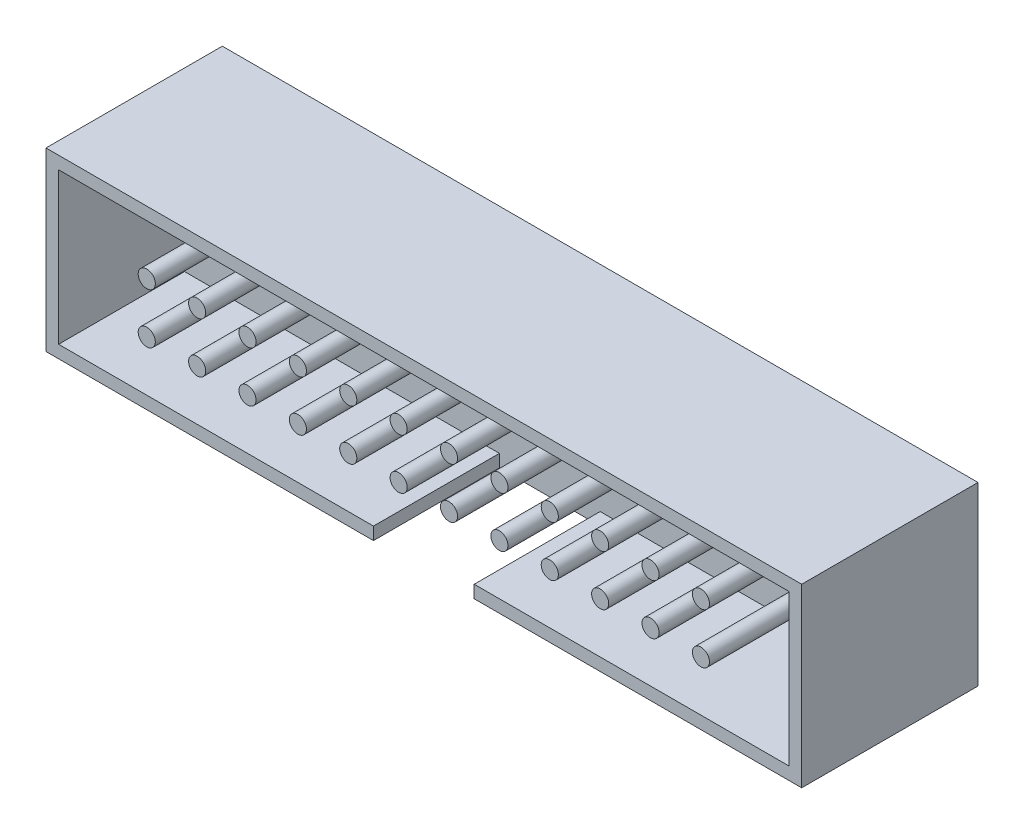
from build123d import *

# Parameters (mm, degrees)
SKETCH1_W                   = 38.1
SKETCH1_H                   = 8.89
BOSS_EXTRUDE1_DEPTH         = 2.54
SKETCH4_W                   = 0.635
SKETCH4_H                   = 8.89
BOSS_EXTRUDE2_DEPTH         = 6.35
SKETCH5_W                   = 36.83
SKETCH5_H                   = 0.635
SKETCH5_W_2                 = 15.875
BOSS_EXTRUDE3_DEPTH         = 6.35
BOSS_EXTRUDE4_DEPTH         = 2.54
BOSS_EXTRUDE4_DEPTH_BACK    = 8.89
SKETCH6_R                   = 0.4318
BOSS_EXTRUDE4_2_DEPTH       = 2.54
BOSS_EXTRUDE4_2_DEPTH_BACK  = 8.89
BOSS_EXTRUDE4_3_DEPTH       = 2.54
BOSS_EXTRUDE4_3_DEPTH_BACK  = 8.89
BOSS_EXTRUDE4_4_DEPTH       = 2.54
BOSS_EXTRUDE4_4_DEPTH_BACK  = 8.89
BOSS_EXTRUDE4_5_DEPTH       = 2.54
BOSS_EXTRUDE4_5_DEPTH_BACK  = 8.89
BOSS_EXTRUDE4_6_DEPTH       = 2.54
BOSS_EXTRUDE4_6_DEPTH_BACK  = 8.89
BOSS_EXTRUDE4_7_DEPTH       = 2.54
BOSS_EXTRUDE4_7_DEPTH_BACK  = 8.89
BOSS_EXTRUDE4_8_DEPTH       = 2.54
BOSS_EXTRUDE4_8_DEPTH_BACK  = 8.89
BOSS_EXTRUDE4_9_DEPTH       = 2.54
BOSS_EXTRUDE4_9_DEPTH_BACK  = 8.89
BOSS_EXTRUDE4_10_DEPTH      = 2.54
BOSS_EXTRUDE4_10_DEPTH_BACK = 8.89
BOSS_EXTRUDE4_11_DEPTH      = 2.54
BOSS_EXTRUDE4_11_DEPTH_BACK = 8.89
BOSS_EXTRUDE4_12_DEPTH      = 2.54
BOSS_EXTRUDE4_12_DEPTH_BACK = 8.89
BOSS_EXTRUDE4_13_DEPTH      = 2.54
BOSS_EXTRUDE4_13_DEPTH_BACK = 8.89
BOSS_EXTRUDE4_14_DEPTH      = 2.54
BOSS_EXTRUDE4_14_DEPTH_BACK = 8.89
BOSS_EXTRUDE4_15_DEPTH      = 2.54
BOSS_EXTRUDE4_15_DEPTH_BACK = 8.89
BOSS_EXTRUDE4_16_DEPTH      = 2.54
BOSS_EXTRUDE4_16_DEPTH_BACK = 8.89
BOSS_EXTRUDE4_17_DEPTH      = 2.54
BOSS_EXTRUDE4_17_DEPTH_BACK = 8.89
BOSS_EXTRUDE4_18_DEPTH      = 2.54
BOSS_EXTRUDE4_18_DEPTH_BACK = 8.89
BOSS_EXTRUDE4_19_DEPTH      = 2.54
BOSS_EXTRUDE4_19_DEPTH_BACK = 8.89
BOSS_EXTRUDE4_20_DEPTH      = 2.54
BOSS_EXTRUDE4_20_DEPTH_BACK = 8.89
BOSS_EXTRUDE4_21_DEPTH      = 2.54
BOSS_EXTRUDE4_21_DEPTH_BACK = 8.89
BOSS_EXTRUDE4_22_DEPTH      = 2.54
BOSS_EXTRUDE4_22_DEPTH_BACK = 8.89
BOSS_EXTRUDE4_23_DEPTH      = 2.54
BOSS_EXTRUDE4_23_DEPTH_BACK = 8.89
BOSS_EXTRUDE4_24_DEPTH      = 2.54
BOSS_EXTRUDE4_24_DEPTH_BACK = 8.89


with BuildPart() as part:
    # Sketch1 → Boss-Extrude1 (new body)
    with BuildSketch(Plane.XY):
        with Locations((13.97, 1.27)):
            Rectangle(SKETCH1_W, SKETCH1_H)
    extrude(amount=BOSS_EXTRUDE1_DEPTH)

    # Sketch4 → Boss-Extrude2 (add)
    with BuildSketch(Plane.XY.offset(2.54)):
        with Locations((-4.7625, 1.27)):
            Rectangle(SKETCH4_W, SKETCH4_H)
        with Locations((32.7025, 1.27)):
            Rectangle(SKETCH4_W, SKETCH4_H)
    extrude(amount=BOSS_EXTRUDE2_DEPTH)

    # Sketch5 → Boss-Extrude3 (add)
    with BuildSketch(Plane.XY.offset(2.54)):
        with Locations((13.97, 5.3975)):
            Rectangle(SKETCH5_W, SKETCH5_H)
        with Locations((3.4925, -2.8575)):
            Rectangle(SKETCH5_W_2, SKETCH5_H)
        with Locations((24.4475, -2.8575)):
            Rectangle(SKETCH5_W_2, SKETCH5_H)
    extrude(amount=BOSS_EXTRUDE3_DEPTH)


with BuildPart() as body_2:
    # Sketch6 → Boss-Extrude4 (new, two sides: drawn at the far end of the back side and taken through both)
    with BuildSketch(Plane(origin=(0, 0, 0), x_dir=(-1, 0, 0), z_dir=(0, 0, -1)).offset(-BOSS_EXTRUDE4_DEPTH_BACK)):
        Circle(SKETCH6_R)
    extrude(amount=BOSS_EXTRUDE4_DEPTH + BOSS_EXTRUDE4_DEPTH_BACK)


with BuildPart() as body_3:
    # Sketch6 → Boss-Extrude4 2 (new, two sides: drawn at the far end of the back side and taken through both)
    with BuildSketch(Plane(origin=(0, 0, 0), x_dir=(-1, 0, 0), z_dir=(0, 0, -1)).offset(-BOSS_EXTRUDE4_2_DEPTH_BACK)):
        with Locations((0, 2.54)):
            Circle(SKETCH6_R)
    extrude(amount=BOSS_EXTRUDE4_2_DEPTH + BOSS_EXTRUDE4_2_DEPTH_BACK)


with BuildPart() as body_4:
    # Sketch6 → Boss-Extrude4 3 (new, two sides: drawn at the far end of the back side and taken through both)
    with BuildSketch(Plane(origin=(0, 0, 0), x_dir=(-1, 0, 0), z_dir=(0, 0, -1)).offset(-BOSS_EXTRUDE4_3_DEPTH_BACK)):
        with Locations((-2.54, 0)):
            Circle(SKETCH6_R)
    extrude(amount=BOSS_EXTRUDE4_3_DEPTH + BOSS_EXTRUDE4_3_DEPTH_BACK)


with BuildPart() as body_5:
    # Sketch6 → Boss-Extrude4 4 (new, two sides: drawn at the far end of the back side and taken through both)
    with BuildSketch(Plane(origin=(0, 0, 0), x_dir=(-1, 0, 0), z_dir=(0, 0, -1)).offset(-BOSS_EXTRUDE4_4_DEPTH_BACK)):
        with Locations((-5.08, 0)):
            Circle(SKETCH6_R)
    extrude(amount=BOSS_EXTRUDE4_4_DEPTH + BOSS_EXTRUDE4_4_DEPTH_BACK)


with BuildPart() as body_6:
    # Sketch6 → Boss-Extrude4 5 (new, two sides: drawn at the far end of the back side and taken through both)
    with BuildSketch(Plane(origin=(0, 0, 0), x_dir=(-1, 0, 0), z_dir=(0, 0, -1)).offset(-BOSS_EXTRUDE4_5_DEPTH_BACK)):
        with Locations((-7.62, 0)):
            Circle(SKETCH6_R)
    extrude(amount=BOSS_EXTRUDE4_5_DEPTH + BOSS_EXTRUDE4_5_DEPTH_BACK)


with BuildPart() as body_7:
    # Sketch6 → Boss-Extrude4 6 (new, two sides: drawn at the far end of the back side and taken through both)
    with BuildSketch(Plane(origin=(0, 0, 0), x_dir=(-1, 0, 0), z_dir=(0, 0, -1)).offset(-BOSS_EXTRUDE4_6_DEPTH_BACK)):
        with Locations((-10.16, 0)):
            Circle(SKETCH6_R)
    extrude(amount=BOSS_EXTRUDE4_6_DEPTH + BOSS_EXTRUDE4_6_DEPTH_BACK)


with BuildPart() as body_8:
    # Sketch6 → Boss-Extrude4 7 (new, two sides: drawn at the far end of the back side and taken through both)
    with BuildSketch(Plane(origin=(0, 0, 0), x_dir=(-1, 0, 0), z_dir=(0, 0, -1)).offset(-BOSS_EXTRUDE4_7_DEPTH_BACK)):
        with Locations((-12.7, 0)):
            Circle(SKETCH6_R)
    extrude(amount=BOSS_EXTRUDE4_7_DEPTH + BOSS_EXTRUDE4_7_DEPTH_BACK)


with BuildPart() as body_9:
    # Sketch6 → Boss-Extrude4 8 (new, two sides: drawn at the far end of the back side and taken through both)
    with BuildSketch(Plane(origin=(0, 0, 0), x_dir=(-1, 0, 0), z_dir=(0, 0, -1)).offset(-BOSS_EXTRUDE4_8_DEPTH_BACK)):
        with Locations((-15.24, 0)):
            Circle(SKETCH6_R)
    extrude(amount=BOSS_EXTRUDE4_8_DEPTH + BOSS_EXTRUDE4_8_DEPTH_BACK)


with BuildPart() as body_10:
    # Sketch6 → Boss-Extrude4 9 (new, two sides: drawn at the far end of the back side and taken through both)
    with BuildSketch(Plane(origin=(0, 0, 0), x_dir=(-1, 0, 0), z_dir=(0, 0, -1)).offset(-BOSS_EXTRUDE4_9_DEPTH_BACK)):
        with Locations((-17.78, 0)):
            Circle(SKETCH6_R)
    extrude(amount=BOSS_EXTRUDE4_9_DEPTH + BOSS_EXTRUDE4_9_DEPTH_BACK)


with BuildPart() as body_11:
    # Sketch6 → Boss-Extrude4 10 (new, two sides: drawn at the far end of the back side and taken through both)
    with BuildSketch(Plane(origin=(0, 0, 0), x_dir=(-1, 0, 0), z_dir=(0, 0, -1)).offset(-BOSS_EXTRUDE4_10_DEPTH_BACK)):
        with Locations((-20.32, 0)):
            Circle(SKETCH6_R)
    extrude(amount=BOSS_EXTRUDE4_10_DEPTH + BOSS_EXTRUDE4_10_DEPTH_BACK)


with BuildPart() as body_12:
    # Sketch6 → Boss-Extrude4 11 (new, two sides: drawn at the far end of the back side and taken through both)
    with BuildSketch(Plane(origin=(0, 0, 0), x_dir=(-1, 0, 0), z_dir=(0, 0, -1)).offset(-BOSS_EXTRUDE4_11_DEPTH_BACK)):
        with Locations((-22.86, 0)):
            Circle(SKETCH6_R)
    extrude(amount=BOSS_EXTRUDE4_11_DEPTH + BOSS_EXTRUDE4_11_DEPTH_BACK)


with BuildPart() as body_13:
    # Sketch6 → Boss-Extrude4 12 (new, two sides: drawn at the far end of the back side and taken through both)
    with BuildSketch(Plane(origin=(0, 0, 0), x_dir=(-1, 0, 0), z_dir=(0, 0, -1)).offset(-BOSS_EXTRUDE4_12_DEPTH_BACK)):
        with Locations((-25.4, 0)):
            Circle(SKETCH6_R)
    extrude(amount=BOSS_EXTRUDE4_12_DEPTH + BOSS_EXTRUDE4_12_DEPTH_BACK)


with BuildPart() as body_14:
    # Sketch6 → Boss-Extrude4 13 (new, two sides: drawn at the far end of the back side and taken through both)
    with BuildSketch(Plane(origin=(0, 0, 0), x_dir=(-1, 0, 0), z_dir=(0, 0, -1)).offset(-BOSS_EXTRUDE4_13_DEPTH_BACK)):
        with Locations((-27.94, 0)):
            Circle(SKETCH6_R)
    extrude(amount=BOSS_EXTRUDE4_13_DEPTH + BOSS_EXTRUDE4_13_DEPTH_BACK)


with BuildPart() as body_15:
    # Sketch6 → Boss-Extrude4 14 (new, two sides: drawn at the far end of the back side and taken through both)
    with BuildSketch(Plane(origin=(0, 0, 0), x_dir=(-1, 0, 0), z_dir=(0, 0, -1)).offset(-BOSS_EXTRUDE4_14_DEPTH_BACK)):
        with Locations((-2.54, 2.54)):
            Circle(SKETCH6_R)
    extrude(amount=BOSS_EXTRUDE4_14_DEPTH + BOSS_EXTRUDE4_14_DEPTH_BACK)


with BuildPart() as body_16:
    # Sketch6 → Boss-Extrude4 15 (new, two sides: drawn at the far end of the back side and taken through both)
    with BuildSketch(Plane(origin=(0, 0, 0), x_dir=(-1, 0, 0), z_dir=(0, 0, -1)).offset(-BOSS_EXTRUDE4_15_DEPTH_BACK)):
        with Locations((-5.08, 2.54)):
            Circle(SKETCH6_R)
    extrude(amount=BOSS_EXTRUDE4_15_DEPTH + BOSS_EXTRUDE4_15_DEPTH_BACK)


with BuildPart() as body_17:
    # Sketch6 → Boss-Extrude4 16 (new, two sides: drawn at the far end of the back side and taken through both)
    with BuildSketch(Plane(origin=(0, 0, 0), x_dir=(-1, 0, 0), z_dir=(0, 0, -1)).offset(-BOSS_EXTRUDE4_16_DEPTH_BACK)):
        with Locations((-7.62, 2.54)):
            Circle(SKETCH6_R)
    extrude(amount=BOSS_EXTRUDE4_16_DEPTH + BOSS_EXTRUDE4_16_DEPTH_BACK)


with BuildPart() as body_18:
    # Sketch6 → Boss-Extrude4 17 (new, two sides: drawn at the far end of the back side and taken through both)
    with BuildSketch(Plane(origin=(0, 0, 0), x_dir=(-1, 0, 0), z_dir=(0, 0, -1)).offset(-BOSS_EXTRUDE4_17_DEPTH_BACK)):
        with Locations((-10.16, 2.54)):
            Circle(SKETCH6_R)
    extrude(amount=BOSS_EXTRUDE4_17_DEPTH + BOSS_EXTRUDE4_17_DEPTH_BACK)


with BuildPart() as body_19:
    # Sketch6 → Boss-Extrude4 18 (new, two sides: drawn at the far end of the back side and taken through both)
    with BuildSketch(Plane(origin=(0, 0, 0), x_dir=(-1, 0, 0), z_dir=(0, 0, -1)).offset(-BOSS_EXTRUDE4_18_DEPTH_BACK)):
        with Locations((-12.7, 2.54)):
            Circle(SKETCH6_R)
    extrude(amount=BOSS_EXTRUDE4_18_DEPTH + BOSS_EXTRUDE4_18_DEPTH_BACK)


with BuildPart() as body_20:
    # Sketch6 → Boss-Extrude4 19 (new, two sides: drawn at the far end of the back side and taken through both)
    with BuildSketch(Plane(origin=(0, 0, 0), x_dir=(-1, 0, 0), z_dir=(0, 0, -1)).offset(-BOSS_EXTRUDE4_19_DEPTH_BACK)):
        with Locations((-15.24, 2.54)):
            Circle(SKETCH6_R)
    extrude(amount=BOSS_EXTRUDE4_19_DEPTH + BOSS_EXTRUDE4_19_DEPTH_BACK)


with BuildPart() as body_21:
    # Sketch6 → Boss-Extrude4 20 (new, two sides: drawn at the far end of the back side and taken through both)
    with BuildSketch(Plane(origin=(0, 0, 0), x_dir=(-1, 0, 0), z_dir=(0, 0, -1)).offset(-BOSS_EXTRUDE4_20_DEPTH_BACK)):
        with Locations((-17.78, 2.54)):
            Circle(SKETCH6_R)
    extrude(amount=BOSS_EXTRUDE4_20_DEPTH + BOSS_EXTRUDE4_20_DEPTH_BACK)


with BuildPart() as body_22:
    # Sketch6 → Boss-Extrude4 21 (new, two sides: drawn at the far end of the back side and taken through both)
    with BuildSketch(Plane(origin=(0, 0, 0), x_dir=(-1, 0, 0), z_dir=(0, 0, -1)).offset(-BOSS_EXTRUDE4_21_DEPTH_BACK)):
        with Locations((-20.32, 2.54)):
            Circle(SKETCH6_R)
    extrude(amount=BOSS_EXTRUDE4_21_DEPTH + BOSS_EXTRUDE4_21_DEPTH_BACK)


with BuildPart() as body_23:
    # Sketch6 → Boss-Extrude4 22 (new, two sides: drawn at the far end of the back side and taken through both)
    with BuildSketch(Plane(origin=(0, 0, 0), x_dir=(-1, 0, 0), z_dir=(0, 0, -1)).offset(-BOSS_EXTRUDE4_22_DEPTH_BACK)):
        with Locations((-22.86, 2.54)):
            Circle(SKETCH6_R)
    extrude(amount=BOSS_EXTRUDE4_22_DEPTH + BOSS_EXTRUDE4_22_DEPTH_BACK)


with BuildPart() as body_24:
    # Sketch6 → Boss-Extrude4 23 (new, two sides: drawn at the far end of the back side and taken through both)
    with BuildSketch(Plane(origin=(0, 0, 0), x_dir=(-1, 0, 0), z_dir=(0, 0, -1)).offset(-BOSS_EXTRUDE4_23_DEPTH_BACK)):
        with Locations((-25.4, 2.54)):
            Circle(SKETCH6_R)
    extrude(amount=BOSS_EXTRUDE4_23_DEPTH + BOSS_EXTRUDE4_23_DEPTH_BACK)


with BuildPart() as body_25:
    # Sketch6 → Boss-Extrude4 24 (new, two sides: drawn at the far end of the back side and taken through both)
    with BuildSketch(Plane(origin=(0, 0, 0), x_dir=(-1, 0, 0), z_dir=(0, 0, -1)).offset(-BOSS_EXTRUDE4_24_DEPTH_BACK)):
        with Locations((-27.94, 2.54)):
            Circle(SKETCH6_R)
    extrude(amount=BOSS_EXTRUDE4_24_DEPTH + BOSS_EXTRUDE4_24_DEPTH_BACK)


solid = Compound([part.part, body_2.part, body_3.part, body_4.part, body_5.part, body_6.part, body_7.part, body_8.part, body_9.part, body_10.part, body_11.part, body_12.part, body_13.part, body_14.part, body_15.part, body_16.part, body_17.part, body_18.part, body_19.part, body_20.part, body_21.part, body_22.part, body_23.part, body_24.part, body_25.part])
